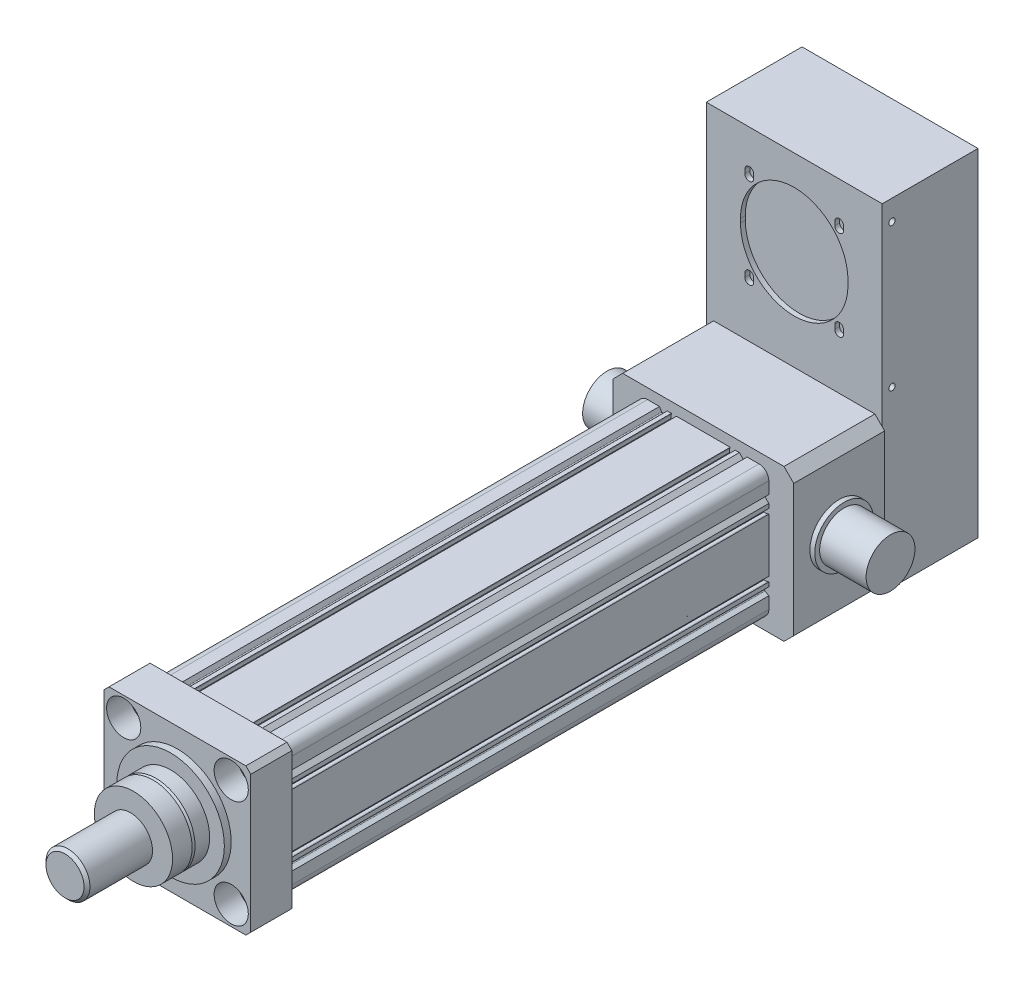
from build123d import *

# Parameters (mm, degrees)
SKETCH_1_R          = 6
EXTRUDE_1_DEPTH     = 496
EXTRUDE_1_2_DEPTH   = 42
SKETCH_3_R          = 6.5
SKETCH_3_R_2        = 8.5
CUT_EXTRUDE_1_DEPTH = 42
SKETCH_3_3_R        = 17.5
SKETCH_3_3_R_2      = 8.5
CUT_EXTRUDE_2_DEPTH = 24
SKETCH_3_4_R        = 55
EXTRUDE_2_DEPTH     = 7
SKETCH_4_R          = 40
EXTRUDE_3_DEPTH     = 18
CHAMFER_1_SIZE      = 3
CHAMFER_1_SIZE2     = 1.091910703
SKETCH_5_R          = 40
EXTRUDE_4_DEPTH     = 20
SKETCH_6_R          = 16.5
EXTRUDE_5_DEPTH     = 3
SKETCH_7_R          = 22.5
EXTRUDE_6_DEPTH     = 67
FILLET_1_R          = 1
CHAMFER_2_SIZE      = 3
SKETCH_8_W          = 185
SKETCH_8_H          = 155
EXTRUDE_7_DEPTH     = 93
SKETCH_12_W         = 180
SKETCH_12_H         = 345
EXTRUDE_9_DEPTH     = 98
SKETCH_14_R         = 3.25
CUT_EXTRUDE_3_DEPTH = 5
SKETCH_15_R         = 3.25
CUT_EXTRUDE_4_DEPTH = 5
CUT_EXTRUDE_5_DEPTH = 5
SKETCH_16_R         = 30
EXTRUDE_10_DEPTH    = 5
EXTRUDE_START       = -190
SKETCH_16_2_R       = 30
EXTRUDE_11_DEPTH    = 5
SKETCH_17_R         = 25
EXTRUDE_12_DEPTH    = 47.5
EXTRUDE_START_2     = -242.5
SKETCH_17_3_R       = 25
EXTRUDE_13_DEPTH    = 47.5
CHAMFER_3_SIZE      = 10


with BuildPart() as part:
    # Sketch 1 → Extrude 1 (new body)
    with BuildSketch(Plane.XY):
        with BuildLine():
            Line((57, 67), (44.8, 67))
            Line((44.8, 67), (42.56486134, 63.12862628))
            ThreePointArc((42.56486134, 63.12862628), (41.829362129, 62.637181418), (40.991729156, 62.921519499))
            Line((40.991729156, 62.921519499), (36.913248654, 67))
            Line((36.913248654, 67), (32.6, 67))
            Line((32.6, 67), (32.6, 66.1))
            Line((32.6, 66.1), (33.2, 65.5))
            Line((33.2, 65.5), (33.2, 62))
            Line((33.2, 62), (26.9, 62))
            Line((26.9, 62), (26.9, 65.5))
            Line((26.9, 65.5), (27.5, 66.1))
            Line((27.5, 66.1), (27.5, 67))
            Line((27.5, 67), (0, 67))
            Line((0, 67), (-27.5, 67))
            Line((-27.5, 67), (-27.5, 66.1))
            Line((-27.5, 66.1), (-26.9, 65.5))
            Line((-26.9, 65.5), (-26.9, 62))
            Line((-26.9, 62), (-33.2, 62))
            Line((-33.2, 62), (-33.2, 65.5))
            Line((-33.2, 65.5), (-32.6, 66.1))
            Line((-32.6, 66.1), (-32.6, 67))
            Line((-32.6, 67), (-36.913248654, 67))
            Line((-36.913248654, 67), (-40.991729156, 62.921519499))
            ThreePointArc((-40.991729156, 62.921519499), (-41.829362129, 62.637181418), (-42.56486134, 63.12862628))
            Line((-42.56486134, 63.12862628), (-44.8, 67))
            Line((-44.8, 67), (-57, 67))
            ThreePointArc((-57, 67), (-64.071067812, 64.071067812), (-67, 57))
            Line((-67, 57), (-67, 44.8))
            Line((-67, 44.8), (-63.12862628, 42.56486134))
            ThreePointArc((-63.12862628, 42.56486134), (-62.637181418, 41.829362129), (-62.921519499, 40.991729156))
            Line((-62.921519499, 40.991729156), (-67, 36.913248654))
            Line((-67, 36.913248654), (-67, 32.6))
            Line((-67, 32.6), (-66.1, 32.6))
            Line((-66.1, 32.6), (-65.5, 33.2))
            Line((-65.5, 33.2), (-62, 33.2))
            Line((-62, 33.2), (-62, 26.9))
            Line((-62, 26.9), (-65.5, 26.9))
            Line((-65.5, 26.9), (-66.1, 27.5))
            Line((-66.1, 27.5), (-67, 27.5))
            Line((-67, 27.5), (-67, 0))
            Line((-67, 0), (-67, -27.5))
            Line((-67, -27.5), (-66.1, -27.5))
            Line((-66.1, -27.5), (-65.5, -26.9))
            Line((-65.5, -26.9), (-62, -26.9))
            Line((-62, -26.9), (-62, -33.2))
            Line((-62, -33.2), (-65.5, -33.2))
            Line((-65.5, -33.2), (-66.1, -32.6))
            Line((-66.1, -32.6), (-67, -32.6))
            Line((-67, -32.6), (-67, -36.913248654))
            Line((-67, -36.913248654), (-62.921519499, -40.991729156))
            ThreePointArc((-62.921519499, -40.991729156), (-62.637181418, -41.829362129), (-63.12862628, -42.56486134))
            Line((-63.12862628, -42.56486134), (-67, -44.8))
            Line((-67, -44.8), (-67, -57))
            ThreePointArc((-67, -57), (-64.071067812, -64.071067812), (-57, -67))
            Line((-57, -67), (-44.8, -67))
            Line((-44.8, -67), (-42.56486134, -63.12862628))
            ThreePointArc((-42.56486134, -63.12862628), (-41.829362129, -62.637181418), (-40.991729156, -62.921519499))
            Line((-40.991729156, -62.921519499), (-36.913248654, -67))
            Line((-36.913248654, -67), (36.913248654, -67))
            Line((36.913248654, -67), (40.991729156, -62.921519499))
            ThreePointArc((40.991729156, -62.921519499), (41.829362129, -62.637181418), (42.56486134, -63.12862628))
            Line((42.56486134, -63.12862628), (44.8, -67))
            Line((44.8, -67), (57, -67))
            ThreePointArc((57, -67), (64.071067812, -64.071067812), (67, -57))
            Line((67, -57), (67, -44.8))
            Line((67, -44.8), (63.12862628, -42.56486134))
            ThreePointArc((63.12862628, -42.56486134), (62.637181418, -41.829362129), (62.921519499, -40.991729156))
            Line((62.921519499, -40.991729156), (67, -36.913248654))
            Line((67, -36.913248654), (67, -32.6))
            Line((67, -32.6), (66.1, -32.6))
            Line((66.1, -32.6), (65.5, -33.2))
            Line((65.5, -33.2), (62, -33.2))
            Line((62, -33.2), (62, -26.9))
            Line((62, -26.9), (65.5, -26.9))
            Line((65.5, -26.9), (66.1, -27.5))
            Line((66.1, -27.5), (67, -27.5))
            Line((67, -27.5), (67, 0))
            Line((67, 0), (67, 27.5))
            Line((67, 27.5), (66.1, 27.5))
            Line((66.1, 27.5), (65.5, 26.9))
            Line((65.5, 26.9), (62, 26.9))
            Line((62, 26.9), (62, 33.2))
            Line((62, 33.2), (65.5, 33.2))
            Line((65.5, 33.2), (66.1, 32.6))
            Line((66.1, 32.6), (67, 32.6))
            Line((67, 32.6), (67, 36.913248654))
            Line((67, 36.913248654), (62.921519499, 40.991729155))
            ThreePointArc((62.921519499, 40.991729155), (62.637181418, 41.829362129), (63.12862628, 42.56486134))
            Line((63.12862628, 42.56486134), (67, 44.8))
            Line((67, 44.8), (67, 57))
            ThreePointArc((67, 57), (64.071067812, 64.071067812), (57, 67))
        make_face()
        with Locations((-55, 55)):
            Circle(SKETCH_1_R, mode=Mode.SUBTRACT)
        with Locations((55, 55)):
            Circle(SKETCH_1_R, mode=Mode.SUBTRACT)
        with Locations((-55, -55)):
            Circle(SKETCH_1_R, mode=Mode.SUBTRACT)
        with Locations((55, -55)):
            Circle(SKETCH_1_R, mode=Mode.SUBTRACT)
        with BuildLine():
            Line((41.774779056, 51.785063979), (43.601329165, 54.94874157))
            ThreePointArc((43.601329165, 54.94874157), (43.701229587, 55.707560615), (43.235303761, 56.314766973))
            Line((43.235303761, 56.314766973), (39.616756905, 58.403935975))
            ThreePointArc((39.616756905, 58.403935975), (39.337726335, 58.513191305), (39.038853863, 58.534871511))
            Line((39.038853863, 58.534871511), (35.747329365, 58.277670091))
            ThreePointArc((35.747329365, 58.277670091), (35.481311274, 58.1068038), (35.28193171, 57.86142918))
            Line((35.28193171, 57.86142918), (34.274000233, 56.115640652))
            ThreePointArc((34.274000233, 56.115640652), (34.174099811, 55.356821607), (34.640025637, 54.749615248))
            Line((34.640025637, 54.749615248), (40.408753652, 51.419038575))
            ThreePointArc((40.408753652, 51.419038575), (41.167572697, 51.319138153), (41.774779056, 51.785063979))
        make_face(mode=Mode.SUBTRACT)
        with BuildLine():
            Line((51.785063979, 41.774779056), (54.94874157, 43.601329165))
            ThreePointArc((54.94874157, 43.601329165), (55.707560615, 43.701229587), (56.314766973, 43.235303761))
            Line((56.314766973, 43.235303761), (58.403935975, 39.616756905))
            ThreePointArc((58.403935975, 39.616756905), (58.513191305, 39.337726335), (58.534871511, 39.038853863))
            Line((58.534871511, 39.038853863), (58.277670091, 35.747329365))
            ThreePointArc((58.277670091, 35.747329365), (58.1068038, 35.481311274), (57.86142918, 35.28193171))
            Line((57.86142918, 35.28193171), (56.115640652, 34.274000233))
            ThreePointArc((56.115640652, 34.274000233), (55.356821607, 34.174099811), (54.749615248, 34.640025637))
            Line((54.749615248, 34.640025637), (51.419038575, 40.408753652))
            ThreePointArc((51.419038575, 40.408753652), (51.319138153, 41.167572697), (51.785063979, 41.774779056))
        make_face(mode=Mode.SUBTRACT)
        with BuildLine():
            Line((-57.86142918, 35.28193171), (-56.115640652, 34.274000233))
            ThreePointArc((-56.115640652, 34.274000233), (-55.356821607, 34.174099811), (-54.749615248, 34.640025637))
            Line((-54.749615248, 34.640025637), (-51.419038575, 40.408753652))
            ThreePointArc((-51.419038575, 40.408753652), (-51.319138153, 41.167572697), (-51.785063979, 41.774779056))
            Line((-51.785063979, 41.774779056), (-54.94874157, 43.601329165))
            ThreePointArc((-54.94874157, 43.601329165), (-55.707560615, 43.701229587), (-56.314766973, 43.235303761))
            Line((-56.314766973, 43.235303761), (-58.403935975, 39.616756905))
            ThreePointArc((-58.403935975, 39.616756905), (-58.513191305, 39.337726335), (-58.534871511, 39.038853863))
            Line((-58.534871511, 39.038853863), (-58.277670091, 35.747329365))
            ThreePointArc((-58.277670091, 35.747329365), (-58.1068038, 35.481311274), (-57.86142918, 35.28193171))
        make_face(mode=Mode.SUBTRACT)
        with BuildLine():
            Line((-33.360371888, -64.600232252), (-19.423193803, -64.600232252))
            ThreePointArc((-19.423193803, -64.600232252), (-18.434155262, -63.747889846), (-19.1311157, -62.643837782))
            ThreePointArc((-19.1311157, -62.643837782), (-26.690004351, -59.815496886), (-33.843674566, -56.079012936))
            ThreePointArc((-33.843674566, -56.079012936), (-34.851952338, -56.064348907), (-35.360371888, -56.935181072))
            Line((-35.360371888, -56.935181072), (-35.360371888, -62.600232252))
            Line((-35.360371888, -62.600232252), (-33.360371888, -64.600232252))
        make_face(mode=Mode.SUBTRACT)
        with BuildLine():
            Line((35.360371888, -62.600232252), (33.360371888, -64.600232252))
            Line((33.360371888, -64.600232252), (19.423193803, -64.600232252))
            ThreePointArc((19.423193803, -64.600232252), (18.434155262, -63.747889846), (19.1311157, -62.643837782))
            ThreePointArc((19.1311157, -62.643837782), (26.690004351, -59.815496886), (33.843674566, -56.079012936))
            ThreePointArc((33.843674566, -56.079012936), (34.851952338, -56.064348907), (35.360371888, -56.935181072))
            Line((35.360371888, -56.935181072), (35.360371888, -62.600232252))
        make_face(mode=Mode.SUBTRACT)
        with BuildLine():
            Line((51.785063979, -41.774779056), (54.94874157, -43.601329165))
            ThreePointArc((54.94874157, -43.601329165), (55.707560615, -43.701229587), (56.314766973, -43.235303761))
            Line((56.314766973, -43.235303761), (58.403935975, -39.616756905))
            ThreePointArc((58.403935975, -39.616756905), (58.513191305, -39.337726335), (58.534871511, -39.038853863))
            Line((58.534871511, -39.038853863), (58.277670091, -35.747329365))
            ThreePointArc((58.277670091, -35.747329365), (58.1068038, -35.481311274), (57.86142918, -35.28193171))
            Line((57.86142918, -35.28193171), (56.115640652, -34.274000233))
            ThreePointArc((56.115640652, -34.274000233), (55.356821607, -34.174099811), (54.749615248, -34.640025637))
            Line((54.749615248, -34.640025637), (51.419038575, -40.408753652))
            ThreePointArc((51.419038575, -40.408753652), (51.319138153, -41.167572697), (51.785063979, -41.774779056))
        make_face(mode=Mode.SUBTRACT)
        with BuildLine():
            Line((-57.86142918, -35.28193171), (-56.115640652, -34.274000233))
            ThreePointArc((-56.115640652, -34.274000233), (-55.356821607, -34.174099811), (-54.749615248, -34.640025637))
            Line((-54.749615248, -34.640025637), (-51.419038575, -40.408753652))
            ThreePointArc((-51.419038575, -40.408753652), (-51.319138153, -41.167572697), (-51.785063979, -41.774779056))
            Line((-51.785063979, -41.774779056), (-54.94874157, -43.601329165))
            ThreePointArc((-54.94874157, -43.601329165), (-55.707560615, -43.701229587), (-56.314766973, -43.235303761))
            Line((-56.314766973, -43.235303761), (-58.403935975, -39.616756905))
            ThreePointArc((-58.403935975, -39.616756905), (-58.513191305, -39.337726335), (-58.534871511, -39.038853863))
            Line((-58.534871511, -39.038853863), (-58.277670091, -35.747329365))
            ThreePointArc((-58.277670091, -35.747329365), (-58.1068038, -35.481311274), (-57.86142918, -35.28193171))
        make_face(mode=Mode.SUBTRACT)
        with BuildLine():
            Line((-41.774779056, 51.785063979), (-43.601329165, 54.94874157))
            ThreePointArc((-43.601329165, 54.94874157), (-43.701229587, 55.707560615), (-43.235303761, 56.314766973))
            Line((-43.235303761, 56.314766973), (-39.616756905, 58.403935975))
            ThreePointArc((-39.616756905, 58.403935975), (-39.337726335, 58.513191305), (-39.038853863, 58.534871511))
            Line((-39.038853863, 58.534871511), (-35.747329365, 58.277670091))
            ThreePointArc((-35.747329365, 58.277670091), (-35.481311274, 58.1068038), (-35.28193171, 57.86142918))
            Line((-35.28193171, 57.86142918), (-34.274000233, 56.115640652))
            ThreePointArc((-34.274000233, 56.115640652), (-34.174099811, 55.356821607), (-34.640025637, 54.749615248))
            Line((-34.640025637, 54.749615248), (-40.408753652, 51.419038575))
            ThreePointArc((-40.408753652, 51.419038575), (-41.167572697, 51.319138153), (-41.774779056, 51.785063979))
        make_face(mode=Mode.SUBTRACT)
        with BuildLine():
            ThreePointArc((62.5, 0), (0, 62.5), (-62.5, 0))
            ThreePointArc((-62.5, 0), (0, -62.5), (62.5, 0))
        make_face(mode=Mode.SUBTRACT)
    extrude(amount=EXTRUDE_1_DEPTH)

    # Sketch 2 → Extrude 1 2 (add)
    with BuildSketch(Plane.XY.offset(496)):
        Polygon((-75, 70), (-70, 75), (70, 75), (75, 70), (75, -70), (70, -75), (-70, -75), (-75, -70), align=None)
    extrude(amount=EXTRUDE_1_2_DEPTH)

    # Sketch 3 → Cut-Extrude 1 (cut)
    with BuildSketch(Plane.XY.offset(538)):
        with Locations((-85, 20)):
            Circle(SKETCH_3_R)
        with Locations((-85, -20)):
            Circle(SKETCH_3_R)
        with Locations((-85, -60)):
            Circle(SKETCH_3_R)
        with Locations((-55, -55)):
            Circle(SKETCH_3_R_2)
        with Locations((-55, 55)):
            Circle(SKETCH_3_R_2)
        with Locations((55, 55)):
            Circle(SKETCH_3_R_2)
        with Locations((85, 60)):
            Circle(SKETCH_3_R)
        with Locations((85, 20)):
            Circle(SKETCH_3_R)
        with Locations((85, -20)):
            Circle(SKETCH_3_R)
        with Locations((85, -60)):
            Circle(SKETCH_3_R)
        with Locations((55, -55)):
            Circle(SKETCH_3_R_2)
        with Locations((-85, 60)):
            Circle(SKETCH_3_R)
    extrude(amount=-CUT_EXTRUDE_1_DEPTH, mode=Mode.SUBTRACT)

    # Sketch 3_3 → Cut-Extrude 2 (cut)
    # profile 1 of 4: a face of its own
    with BuildSketch(Plane.XY.offset(538)):
        with Locations((55, 55)):
            Circle(SKETCH_3_3_R)
        with Locations((55, 55)):
            Circle(SKETCH_3_3_R_2, mode=Mode.SUBTRACT)
    # profile 2 of 4: a face of its own
    with BuildSketch(Plane.XY.offset(538)):
        with Locations((55, -55)):
            Circle(SKETCH_3_3_R)
        with Locations((55, -55)):
            Circle(SKETCH_3_3_R_2, mode=Mode.SUBTRACT)
    # profile 3 of 4: a face of its own
    with BuildSketch(Plane.XY.offset(538)):
        with Locations((-55, -55)):
            Circle(SKETCH_3_3_R)
        with Locations((-55, -55)):
            Circle(SKETCH_3_3_R_2, mode=Mode.SUBTRACT)
    # profile 4 of 4: a face of its own
    with BuildSketch(Plane.XY.offset(538)):
        with Locations((-55, 55)):
            Circle(SKETCH_3_3_R)
    extrude(amount=-CUT_EXTRUDE_2_DEPTH, mode=Mode.SUBTRACT)

    # Sketch 3_4 → Extrude 2 (add)
    with BuildSketch(Plane.XY.offset(538)):
        with Locations(Location((0, 0, 0), (0, 0, 180))):
            Circle(SKETCH_3_4_R)
    extrude(amount=EXTRUDE_2_DEPTH)

    # Sketch 4 → Extrude 3 (add)
    with BuildSketch(Plane.XY.offset(545)):
        Circle(SKETCH_4_R)
    extrude(amount=EXTRUDE_3_DEPTH)

    # Chamfer 1
    chamfer_1_edges = [part.edges().sort_by_distance(p)[0] for p in [
        (-40, 0, 563),
    ]]
    chamfer_1_side = [part.faces().sort_by_distance(p)[0] for p in [
        (-40, 0, 554),
    ]]
    chamfer(chamfer_1_edges, length=CHAMFER_1_SIZE, length2=CHAMFER_1_SIZE2, reference=chamfer_1_side[0])

    # Sketch 5 → Extrude 4 (add)
    with BuildSketch(Plane.XY.offset(563)):
        Circle(SKETCH_5_R)
    extrude(amount=EXTRUDE_4_DEPTH)

    # Sketch 6 → Extrude 5 (add)
    with BuildSketch(Plane.XY.offset(583)):
        Circle(SKETCH_6_R)
    extrude(amount=EXTRUDE_5_DEPTH)

    # Sketch 7 → Extrude 6 (add)
    with BuildSketch(Plane.XY.offset(586)):
        Circle(SKETCH_7_R)
    extrude(amount=EXTRUDE_6_DEPTH)

    # Fillet 1
    fillet_1_edges = [part.edges().sort_by_distance(p)[0] for p in [
        (-16.5, 0, 583),
    ]]
    fillet(fillet_1_edges, radius=FILLET_1_R)

    # Chamfer 2
    chamfer_2_edges = [part.edges().sort_by_distance(p)[0] for p in [
        (-22.5, 0, 653),
    ]]
    chamfer(chamfer_2_edges, length=CHAMFER_2_SIZE)

    # Sketch 8 → Extrude 7 (add)
    with BuildSketch(Plane(origin=(0, 0, 0), x_dir=(-1, 0, 0), z_dir=(0, 0, -1))):
        Rectangle(SKETCH_8_W, SKETCH_8_H)
    extrude(amount=EXTRUDE_7_DEPTH)

    # Sketch 16 → Extrude 10 (add)
    with BuildSketch(Plane.ZY.offset(92.5)):
        with Locations(Location((-46.5, 0, 0), (0, 0, 270))):
            Circle(SKETCH_16_R)
    extrude(amount=EXTRUDE_10_DEPTH)

    # Sketch 16_2 → Extrude 11 (add)
    with BuildSketch(Plane.ZY.offset(92.5).offset(EXTRUDE_START)):
        with Locations(Location((-46.5, 0, 0), (0, 0, 270))):
            Circle(SKETCH_16_2_R)
    extrude(amount=EXTRUDE_11_DEPTH)

    # Sketch 17 → Extrude 12 (add)
    with BuildSketch(Plane.ZY.offset(97.5)):
        with Locations(Location((-46.5, 0, 0), (0, 0, 270))):
            Circle(SKETCH_17_R)
    extrude(amount=EXTRUDE_12_DEPTH)

    # Sketch 17_3 → Extrude 13 (add)
    with BuildSketch(Plane.ZY.offset(97.5).offset(EXTRUDE_START_2)):
        with Locations(Location((-46.5, 0, 0), (0, 0, 270))):
            Circle(SKETCH_17_3_R)
    extrude(amount=EXTRUDE_13_DEPTH)

    # Chamfer 3
    chamfer_3_edges = [part.edges().sort_by_distance(p)[0] for p in [
        (-92.5, -77.5, -46.5),
        (-92.5, 77.5, -46.5),
        (92.5, 77.5, -46.5),
        (92.5, -77.5, -46.5),
    ]]
    chamfer(chamfer_3_edges, length=CHAMFER_3_SIZE)


with BuildPart() as body_2:
    # Sketch 12 → Extrude 9 (new body)
    with BuildSketch(Plane(origin=(0, 0, -93), x_dir=(-1, 0, 0), z_dir=(0, 0, -1))):
        with Locations((0, 95)):
            Rectangle(SKETCH_12_W, SKETCH_12_H)
    extrude(amount=EXTRUDE_9_DEPTH)

    # Sketch 14 → Cut-Extrude 3 (cut)
    with BuildSketch(Plane.ZY.offset(90)):
        with Locations(Location((-103, -53.5, 0), (0, 0, 270))):
            Circle(SKETCH_14_R)
        with Locations(Location((-103, 100, 0), (0, 0, 270))):
            Circle(SKETCH_14_R)
        with Locations(Location((-103, 246.5, 0), (0, 0, 270))):
            Circle(SKETCH_14_R)
    extrude(amount=-CUT_EXTRUDE_3_DEPTH, mode=Mode.SUBTRACT)

    # Sketch 15 → Cut-Extrude 4 (cut)
    with BuildSketch(Plane(origin=(90, 0, 0), x_dir=(0, 0, -1), z_dir=(1, 0, 0))):
        with Locations(Location((103, 246.5, 0), (0, 0, 270))):
            Circle(SKETCH_15_R)
        with Locations(Location((103, 100, 0), (0, 0, 270))):
            Circle(SKETCH_15_R)
        with Locations(Location((103, -53.5, 0), (0, 0, 270))):
            Circle(SKETCH_15_R)
    extrude(amount=-CUT_EXTRUDE_4_DEPTH, mode=Mode.SUBTRACT)

    # Sketch 13 → Cut-Extrude 5 (cut)
    with BuildSketch(Plane.XY.offset(-93)):
        with BuildLine():
            Line((-55, 182), (-55, 178))
            ThreePointArc((-55, 178), (0, 123), (55, 178))
            Line((55, 178), (55, 182))
            ThreePointArc((55, 182), (0, 237), (-55, 182))
        make_face()
        with BuildLine():
            Line((-50.461940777, 223.961940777), (-50.461940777, 227.961940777))
            ThreePointArc((-50.461940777, 227.961940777), (-45.961940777, 232.461940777), (-41.461940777, 227.961940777))
            Line((-41.461940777, 227.961940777), (-41.461940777, 223.961940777))
            ThreePointArc((-41.461940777, 223.961940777), (-45.961940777, 219.461940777), (-50.461940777, 223.961940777))
        make_face()
        with BuildLine():
            Line((50.461940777, 223.961940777), (50.461940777, 227.961940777))
            ThreePointArc((50.461940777, 227.961940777), (45.961940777, 232.461940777), (41.461940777, 227.961940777))
            Line((41.461940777, 227.961940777), (41.461940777, 223.961940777))
            ThreePointArc((41.461940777, 223.961940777), (45.961940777, 219.461940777), (50.461940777, 223.961940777))
        make_face()
        with BuildLine():
            Line((50.461940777, 136.038059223), (50.461940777, 132.038059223))
            ThreePointArc((50.461940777, 132.038059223), (45.961940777, 127.538059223), (41.461940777, 132.038059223))
            Line((41.461940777, 132.038059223), (41.461940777, 136.038059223))
            ThreePointArc((41.461940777, 136.038059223), (45.961940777, 140.538059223), (50.461940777, 136.038059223))
        make_face()
        with BuildLine():
            Line((-50.461940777, 136.038059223), (-50.461940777, 132.038059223))
            ThreePointArc((-50.461940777, 132.038059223), (-45.961940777, 127.538059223), (-41.461940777, 132.038059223))
            Line((-41.461940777, 132.038059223), (-41.461940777, 136.038059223))
            ThreePointArc((-41.461940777, 136.038059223), (-45.961940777, 140.538059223), (-50.461940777, 136.038059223))
        make_face()
    extrude(amount=-CUT_EXTRUDE_5_DEPTH, mode=Mode.SUBTRACT)


solid = Compound([part.part, body_2.part])
